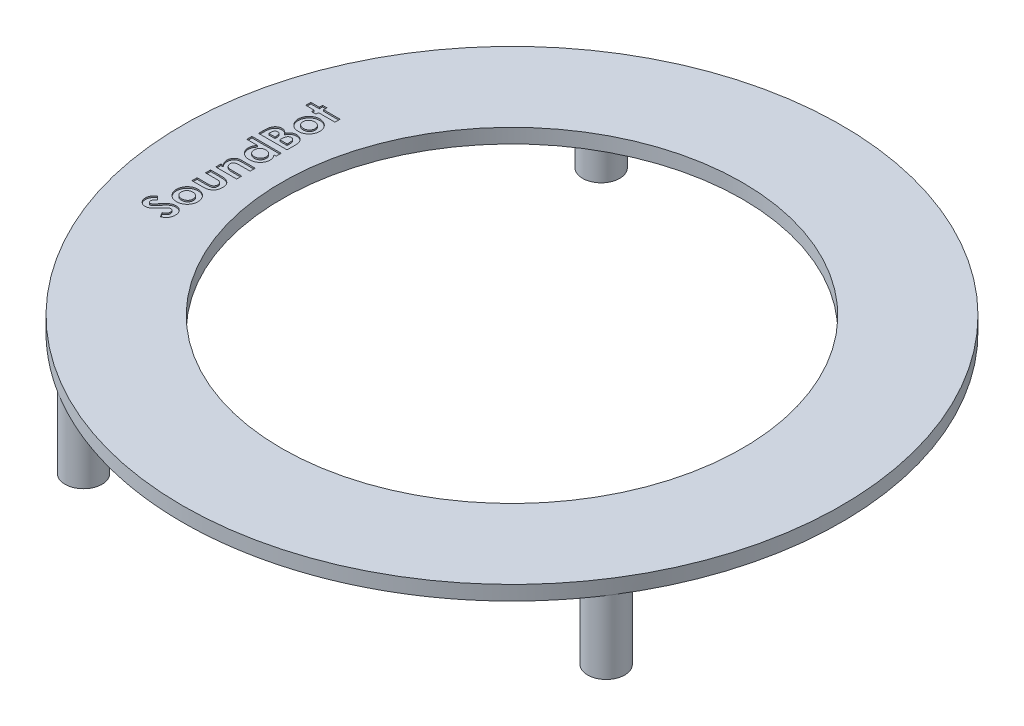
from build123d import *

# Parameters (mm, degrees)
SKETCH1_R           = 29.337
SKETCH1_R_2         = 20.5105
BOSS_EXTRUDE1_DEPTH = 1.2827
SKETCH2_R           = 1.651
SKETCH2_R_2         = 0.762
BOSS_EXTRUDE2_DEPTH = 6.5024
CUT_EXTRUDE3_DEPTH  = 0.127


with BuildPart() as part:
    # Sketch1 → Boss-Extrude1 (new body)
    with BuildSketch(Plane(origin=(0, 0, 0), x_dir=(1, 0, 0), z_dir=(0, 1, 0))):
        with Locations(Location((0, 0, 0), (0, 0, 270))):
            Circle(SKETCH1_R)
        with Locations(Location((0, 0, 0), (0, 0, 270))):
            Circle(SKETCH1_R_2, mode=Mode.SUBTRACT)
    extrude(amount=BOSS_EXTRUDE1_DEPTH)

    # Sketch2 → Boss-Extrude2 (add)
    # profile 1 of 4: a face of its own
    with BuildSketch(Plane.XZ):
        with Locations(Location((23.314362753, 14.931680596, 0), (0, 0, 32.636876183))):
            Circle(SKETCH2_R)
        with Locations(Location((23.314362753, 14.931680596, 0), (0, 0, 270))):
            Circle(SKETCH2_R_2, mode=Mode.SUBTRACT)
    # profile 2 of 4: a face of its own
    with BuildSketch(Plane.XZ):
        with Locations(Location((15.2019, -23.139075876, 0), (0, 0, 303.303446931))):
            Circle(SKETCH2_R)
        with Locations(Location((15.2019, -23.139075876, 0), (0, 0, 270))):
            Circle(SKETCH2_R_2, mode=Mode.SUBTRACT)
    # profile 3 of 4: a face of its own
    with BuildSketch(Plane.XZ):
        with Locations(Location((-15.2019, -23.139075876, 0), (0, 0, 236.695254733))):
            Circle(SKETCH2_R)
        with Locations(Location((-15.2019, -23.139075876, 0), (0, 0, 270))):
            Circle(SKETCH2_R_2, mode=Mode.SUBTRACT)
    # profile 4 of 4: a face of its own
    with BuildSketch(Plane.XZ):
        with Locations(Location((-14.659440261, 23.486494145, 0), (0, 0, 121.970304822))):
            Circle(SKETCH2_R)
        with Locations(Location((-14.659440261, 23.486494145, 0), (0, 0, 270))):
            Circle(SKETCH2_R_2, mode=Mode.SUBTRACT)
    extrude(amount=BOSS_EXTRUDE2_DEPTH)

    # Sketch3 → Cut-Extrude3 (cut)
    # profile 1 of 8: a face of its own
    with BuildSketch(Plane(origin=(0, 1.2827, 0), x_dir=(1, 0, 0), z_dir=(0, 1, 0))):
        with BuildLine():
            Line((-24.977884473, -6.560601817), (-24.665981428, -6.901507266))
            add(Edge.make_bspline(
                [(-24.665981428, -6.901507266), (-24.686580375, -6.916110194), (-24.726127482, -6.944145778), (-24.77908199, -6.989588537), (-24.824256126, -7.034826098), (-24.861461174, -7.08027756), (-24.890471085, -7.126345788), (-24.911010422, -7.172950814), (-24.924067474, -7.219828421), (-24.925693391, -7.251322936), (-24.926494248, -7.266835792)],
                knots=[0, 0, 0, 0, 1.299362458, 2.494594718, 3.587462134, 4.587049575, 5.512617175, 6.380583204, 7.202344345, 8, 8, 8, 8], degree=3))
            add(Edge.make_bspline(
                [(-24.926494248, -7.266835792), (-24.926001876, -7.28131288), (-24.925051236, -7.309264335), (-24.915126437, -7.348925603), (-24.899088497, -7.384567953), (-24.876934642, -7.415241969), (-24.85047651, -7.439918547), (-24.822310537, -7.45910606), (-24.791600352, -7.470255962), (-24.770538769, -7.47168783), (-24.760112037, -7.472396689)],
                knots=[0, 0, 0, 0, 1.184157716, 2.286297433, 3.324836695, 4.370048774, 5.362957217, 6.276446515, 7.146738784, 8, 8, 8, 8], degree=3))
            add(Edge.make_bspline(
                [(-24.760112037, -7.472396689), (-24.74953984, -7.471947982), (-24.728248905, -7.471044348), (-24.697044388, -7.462316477), (-24.666553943, -7.449161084), (-24.647992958, -7.436590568), (-24.638505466, -7.430165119)],
                knots=[0, 0, 0, 0, 0.967525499, 1.948461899, 2.951351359, 4, 4, 4, 4], degree=3))
            add(Edge.make_bspline(
                [(-24.638505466, -7.430165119), (-24.631151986, -7.424300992), (-24.614127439, -7.410724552), (-24.586756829, -7.385599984), (-24.554405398, -7.352793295), (-24.516400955, -7.313119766), (-24.47238267, -7.266717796), (-24.423085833, -7.212867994), (-24.368989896, -7.151176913), (-24.330852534, -7.107907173), (-24.310829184, -7.085189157)],
                knots=[0, 0, 0, 0, 0.473854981, 1.097054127, 1.870604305, 2.795416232, 3.865517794, 5.093525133, 6.47400653, 8, 8, 8, 8], degree=3))
            add(Edge.make_bspline(
                [(-24.310829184, -7.085189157), (-24.292343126, -7.063818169), (-24.257260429, -7.023260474), (-24.207384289, -6.965628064), (-24.162713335, -6.914649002), (-24.122913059, -6.870786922), (-24.089622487, -6.832731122), (-24.060793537, -6.802164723), (-24.03768735, -6.777779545), (-24.023715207, -6.763931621), (-24.017752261, -6.758021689)],
                knots=[0, 0, 0, 0, 1.543627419, 2.929484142, 4.163674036, 5.24627963, 6.164986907, 6.925413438, 7.541394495, 8, 8, 8, 8], degree=3))
            add(Edge.make_bspline(
                [(-24.017752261, -6.758021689), (-23.993483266, -6.735599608), (-23.946829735, -6.692496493), (-23.874549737, -6.63644332), (-23.804051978, -6.590512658), (-23.734184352, -6.554565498), (-23.663333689, -6.527666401), (-23.589971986, -6.508821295), (-23.513542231, -6.497363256), (-23.461488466, -6.496108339), (-23.435160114, -6.495473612)],
                knots=[0, 0, 0, 0, 1.206593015, 2.319495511, 3.336910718, 4.276265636, 5.184178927, 6.099356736, 7.038670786, 8, 8, 8, 8], degree=3))
            add(Edge.make_bspline(
                [(-23.435160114, -6.495473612), (-23.409507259, -6.495928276), (-23.359175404, -6.496820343), (-23.28552223, -6.507746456), (-23.215032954, -6.523326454), (-23.148474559, -6.547415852), (-23.084754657, -6.576775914), (-23.024865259, -6.613582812), (-22.968202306, -6.656808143), (-22.915770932, -6.706348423), (-22.868215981, -6.761155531), (-22.825797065, -6.819905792), (-22.791053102, -6.883398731), (-22.761297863, -6.950369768), (-22.740123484, -7.022041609), (-22.723464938, -7.097107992), (-22.713705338, -7.17634915), (-22.712666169, -7.230513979), (-22.712135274, -7.258185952)],
                knots=[0, 0, 0, 0, 1.043169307, 2.046737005, 3.02462096, 3.976528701, 4.921503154, 5.875710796, 6.831116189, 7.817539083, 8.805892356, 9.780872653, 10.7604363, 11.74661763, 12.757588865, 13.796088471, 14.874055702, 16, 16, 16, 16], degree=3))
            add(Edge.make_bspline(
                [(-22.712135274, -7.258185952), (-22.712520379, -7.279909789), (-22.713283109, -7.322935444), (-22.719518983, -7.386346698), (-22.729561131, -7.447585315), (-22.744030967, -7.506545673), (-22.762115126, -7.563689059), (-22.785201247, -7.618458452), (-22.81174098, -7.671247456), (-22.842304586, -7.721947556), (-22.877821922, -7.770239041), (-22.916902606, -7.817475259), (-22.961439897, -7.86210026), (-23.010569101, -7.905114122), (-23.064591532, -7.94596178), (-23.122687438, -7.986037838), (-23.185954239, -8.02354508), (-23.230335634, -8.046715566), (-23.253004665, -8.058550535)],
                knots=[0, 0, 0, 0, 1.016956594, 2.014157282, 2.980233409, 3.920138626, 4.854357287, 5.783465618, 6.699725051, 7.61900777, 8.551402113, 9.504102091, 10.486778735, 11.499758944, 12.559144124, 13.656050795, 14.802762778, 16, 16, 16, 16], degree=3))
            Line((-23.253004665, -8.058550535), (-23.493673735, -7.657605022))
            add(Edge.make_bspline(
                [(-23.493673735, -7.657605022), (-23.467941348, -7.642801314), (-23.418610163, -7.61442134), (-23.352327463, -7.566328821), (-23.295567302, -7.51706049), (-23.24933292, -7.465477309), (-23.213006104, -7.412206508), (-23.187044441, -7.356990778), (-23.170974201, -7.299791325), (-23.169011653, -7.260829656), (-23.16803271, -7.241395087)],
                knots=[0, 0, 0, 0, 1.283663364, 2.460892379, 3.537111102, 4.529833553, 5.449777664, 6.316464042, 7.160231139, 8, 8, 8, 8], degree=3))
            add(Edge.make_bspline(
                [(-23.16803271, -7.241395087), (-23.168832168, -7.221627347), (-23.170383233, -7.183275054), (-23.184709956, -7.128532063), (-23.207203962, -7.078341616), (-23.239299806, -7.034957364), (-23.276343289, -6.998222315), (-23.317555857, -6.97110974), (-23.362146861, -6.954077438), (-23.393122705, -6.952276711), (-23.40870178, -6.951371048)],
                knots=[0, 0, 0, 0, 1.13588714, 2.203786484, 3.234766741, 4.283437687, 5.291419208, 6.222934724, 7.106237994, 8, 8, 8, 8], degree=3))
            add(Edge.make_bspline(
                [(-23.40870178, -6.951371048), (-23.423195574, -6.95220739), (-23.452638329, -6.95390634), (-23.496414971, -6.966420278), (-23.540171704, -6.985983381), (-23.576062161, -7.009127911), (-23.606112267, -7.032680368), (-23.632149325, -7.055201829), (-23.660915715, -7.082627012), (-23.692447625, -7.114886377), (-23.727022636, -7.151553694), (-23.764637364, -7.192659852), (-23.804960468, -7.238675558), (-23.832428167, -7.27119955), (-23.846790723, -7.288205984)],
                knots=[0, 0, 0, 0, 0.916159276, 1.861089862, 2.860218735, 3.940849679, 4.552606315, 5.27541173, 6.11797699, 7.06649574, 8.129236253, 9.306560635, 10.591630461, 12, 12, 12, 12], degree=3))
            add(Edge.make_bspline(
                [(-23.846790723, -7.288205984), (-23.874144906, -7.32053592), (-23.926645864, -7.382586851), (-24.004188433, -7.47027226), (-24.076657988, -7.549286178), (-24.144955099, -7.618939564), (-24.207803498, -7.680141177), (-24.265761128, -7.732409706), (-24.319236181, -7.775465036), (-24.382998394, -7.820156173), (-24.460006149, -7.863133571), (-24.552596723, -7.900347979), (-24.645268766, -7.924265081), (-24.707569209, -7.926965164), (-24.73823303, -7.928294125)],
                knots=[0, 0, 0, 0, 1.345561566, 2.582539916, 3.71901348, 4.751744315, 5.681651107, 6.506005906, 7.230637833, 7.861516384, 8.978504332, 10.023243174, 11.027054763, 12, 12, 12, 12], degree=3))
            add(Edge.make_bspline(
                [(-24.73823303, -7.928294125), (-24.759979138, -7.927743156), (-24.802821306, -7.926657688), (-24.86581464, -7.916975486), (-24.92659726, -7.902504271), (-24.984950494, -7.881490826), (-25.040789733, -7.854207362), (-25.094432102, -7.821112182), (-25.145314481, -7.781430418), (-25.193937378, -7.737280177), (-25.237916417, -7.688049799), (-25.27671234, -7.635660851), (-25.309656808, -7.580343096), (-25.336102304, -7.521883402), (-25.357094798, -7.460759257), (-25.371800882, -7.396816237), (-25.380593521, -7.330174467), (-25.381784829, -7.284840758), (-25.382391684, -7.261747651)],
                knots=[0, 0, 0, 0, 1.010608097, 1.99100651, 2.956992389, 3.912457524, 4.868345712, 5.842283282, 6.837666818, 7.864758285, 8.892394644, 9.901925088, 10.892014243, 11.880216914, 12.880338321, 13.892361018, 14.926363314, 16, 16, 16, 16], degree=3))
            add(Edge.make_bspline(
                [(-25.382391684, -7.261747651), (-25.381296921, -7.231820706), (-25.379116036, -7.172203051), (-25.362061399, -7.08405705), (-25.335243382, -6.997958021), (-25.30288352, -6.92858325), (-25.271552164, -6.873370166), (-25.24265964, -6.831093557), (-25.209687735, -6.787823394), (-25.171707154, -6.744229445), (-25.129963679, -6.699253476), (-25.083495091, -6.653559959), (-25.032779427, -6.606662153), (-24.996503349, -6.576224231), (-24.977884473, -6.560601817)],
                knots=[0, 0, 0, 0, 1.282949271, 2.555771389, 3.837399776, 5.142782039, 5.830402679, 6.558840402, 7.337330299, 8.162747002, 9.037840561, 9.968992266, 10.957575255, 12, 12, 12, 12], degree=3))
        make_face()
    # profile 2 of 8: a face of its own
    with BuildSketch(Plane(origin=(0, 1.2827, 0), x_dir=(1, 0, 0), z_dir=(0, 1, 0))):
        with BuildLine():
            add(Edge.make_bspline(
                [(-24.665981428, -5.220385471), (-24.665602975, -5.19883028), (-24.664853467, -5.156141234), (-24.658455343, -5.092583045), (-24.648415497, -5.03001243), (-24.634005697, -4.968566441), (-24.616327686, -4.907895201), (-24.593614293, -4.848643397), (-24.567918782, -4.789720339), (-24.537215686, -4.732768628), (-24.503958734, -4.677323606), (-24.467210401, -4.62481119), (-24.427449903, -4.575335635), (-24.384805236, -4.529060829), (-24.339242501, -4.486255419), (-24.291250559, -4.446118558), (-24.239805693, -4.409774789), (-24.186019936, -4.37617493), (-24.130268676, -4.346248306), (-24.07292239, -4.320265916), (-24.014778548, -4.297714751), (-23.955127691, -4.28005786), (-23.894756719, -4.265439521), (-23.832925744, -4.256214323), (-23.770269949, -4.249655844), (-23.72808491, -4.24892043), (-23.706866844, -4.248550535)],
                knots=[0, 0, 0, 0, 1.022405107, 2.024825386, 3.027536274, 4.026883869, 5.01725043, 6.023055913, 7.035310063, 8.064783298, 9.090097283, 10.101295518, 11.102843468, 12.099336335, 13.084064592, 14.066917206, 15.06496821, 16.069711, 17.07409931, 18.064335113, 19.055093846, 20.030042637, 21.013718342, 21.999268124, 22.993679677, 24, 24, 24, 24], degree=3))
            add(Edge.make_bspline(
                [(-23.706866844, -4.248550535), (-23.685483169, -4.248941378), (-23.642967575, -4.249718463), (-23.579720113, -4.255971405), (-23.517607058, -4.266354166), (-23.456369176, -4.279630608), (-23.396665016, -4.298623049), (-23.337489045, -4.31992035), (-23.279950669, -4.34705014), (-23.223150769, -4.376650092), (-23.168463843, -4.409969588), (-23.116802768, -4.446949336), (-23.068072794, -4.486581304), (-23.02200993, -4.528730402), (-22.9796667, -4.574307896), (-22.940444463, -4.622909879), (-22.903813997, -4.674052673), (-22.870648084, -4.72812111), (-22.841505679, -4.784418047), (-22.815231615, -4.841995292), (-22.793356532, -4.901189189), (-22.775518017, -4.961877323), (-22.761706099, -5.024096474), (-22.752323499, -5.087709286), (-22.745798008, -5.152578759), (-22.745067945, -5.196285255), (-22.744699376, -5.218350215)],
                knots=[0, 0, 0, 0, 1.012065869, 2.012216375, 3.004733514, 3.992205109, 4.97496602, 5.968164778, 6.966799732, 7.983091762, 8.999225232, 9.995016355, 10.988052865, 11.970944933, 12.947950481, 13.92969433, 14.925485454, 15.92373309, 16.929186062, 17.924491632, 18.917690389, 19.913513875, 20.91665649, 21.931711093, 22.955836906, 24, 24, 24, 24], degree=3))
            add(Edge.make_bspline(
                [(-22.744699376, -5.218350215), (-22.745647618, -5.250613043), (-22.747516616, -5.31420357), (-22.760284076, -5.407868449), (-22.782357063, -5.497806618), (-22.812815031, -5.584436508), (-22.853043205, -5.66695938), (-22.900757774, -5.74649269), (-22.958608, -5.821430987), (-23.023370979, -5.892521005), (-23.094661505, -5.957158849), (-23.170275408, -6.014196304), (-23.249972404, -6.06213863), (-23.333432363, -6.101701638), (-23.420796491, -6.132203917), (-23.511765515, -6.154240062), (-23.606605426, -6.16704042), (-23.671042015, -6.168891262), (-23.70381396, -6.169832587)],
                knots=[0, 0, 0, 0, 1.030098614, 2.030340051, 3.011502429, 3.982690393, 4.9563966, 5.938096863, 6.938909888, 7.973851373, 9.005145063, 10.007012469, 10.993347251, 11.969610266, 12.95101174, 13.942698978, 14.953672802, 16, 16, 16, 16], degree=3))
            add(Edge.make_bspline(
                [(-23.70381396, -6.169832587), (-23.738807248, -6.16885848), (-23.807585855, -6.166943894), (-23.908348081, -6.151741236), (-24.004823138, -6.12746423), (-24.096741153, -6.092616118), (-24.184271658, -6.048100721), (-24.26723004, -5.993757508), (-24.345635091, -5.929317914), (-24.393057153, -5.879970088), (-24.417171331, -5.854876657)],
                knots=[0, 0, 0, 0, 1.043912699, 2.05178951, 3.033892, 4.007821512, 4.978932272, 5.95884105, 6.962068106, 8, 8, 8, 8], degree=3))
            add(Edge.make_bspline(
                [(-24.417171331, -5.854876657), (-24.437159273, -5.831850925), (-24.476591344, -5.786425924), (-24.526604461, -5.712625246), (-24.569800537, -5.63706168), (-24.605315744, -5.558829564), (-24.632093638, -5.477710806), (-24.651585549, -5.394121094), (-24.663558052, -5.308077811), (-24.665169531, -5.249764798), (-24.665981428, -5.220385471)],
                knots=[0, 0, 0, 0, 1.048115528, 2.067714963, 3.060638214, 4.039924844, 5.017819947, 5.994373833, 6.98952318, 8, 8, 8, 8], degree=3))
        make_face()
        with BuildLine():
            add(Edge.make_bspline(
                [(-24.242648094, -5.210209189), (-24.24208267, -5.227866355), (-24.240969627, -5.262624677), (-24.234473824, -5.313645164), (-24.222877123, -5.362354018), (-24.205497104, -5.40840458), (-24.18504963, -5.452963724), (-24.158773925, -5.494775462), (-24.12791478, -5.534154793), (-24.093090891, -5.571256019), (-24.054155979, -5.604399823), (-24.012488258, -5.633792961), (-23.968333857, -5.658917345), (-23.921008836, -5.678562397), (-23.871551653, -5.694611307), (-23.81917184, -5.705511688), (-23.764414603, -5.71308662), (-23.726907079, -5.713649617), (-23.707884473, -5.713935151)],
                knots=[0, 0, 0, 0, 1.030405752, 2.028364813, 2.995676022, 3.944329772, 4.896127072, 5.85177522, 6.817820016, 7.811895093, 8.815529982, 9.795715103, 10.783861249, 11.772750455, 12.780524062, 13.813161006, 14.890905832, 16, 16, 16, 16], degree=3))
            add(Edge.make_bspline(
                [(-23.707884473, -5.713935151), (-23.688190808, -5.713601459), (-23.649703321, -5.712949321), (-23.593507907, -5.706190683), (-23.540173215, -5.695057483), (-23.489807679, -5.679199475), (-23.442093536, -5.659455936), (-23.397485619, -5.634735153), (-23.355758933, -5.605704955), (-23.317076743, -5.572619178), (-23.28214992, -5.536146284), (-23.251260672, -5.496979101), (-23.22604109, -5.454783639), (-23.204123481, -5.410988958), (-23.188129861, -5.364370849), (-23.176123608, -5.315713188), (-23.169709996, -5.264482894), (-23.168599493, -5.229559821), (-23.16803271, -5.211735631)],
                knots=[0, 0, 0, 0, 1.141979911, 2.23178043, 3.277659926, 4.298338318, 5.290546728, 6.26815979, 7.25071132, 8.234641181, 9.215812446, 10.176243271, 11.121178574, 12.06282999, 13.01190517, 13.973595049, 14.965754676, 16, 16, 16, 16], degree=3))
            add(Edge.make_bspline(
                [(-23.16803271, -5.211735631), (-23.168534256, -5.193901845), (-23.169517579, -5.158937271), (-23.176881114, -5.10765644), (-23.188469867, -5.058715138), (-23.204824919, -5.011898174), (-23.226276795, -4.967584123), (-23.25255164, -4.925603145), (-23.283066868, -4.885586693), (-23.318798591, -4.848851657), (-23.35755843, -4.814855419), (-23.399582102, -4.785010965), (-23.444423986, -4.760264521), (-23.491832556, -4.739444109), (-23.542077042, -4.723930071), (-23.595061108, -4.712837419), (-23.650510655, -4.70528385), (-23.688523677, -4.704730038), (-23.707884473, -4.704447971)],
                knots=[0, 0, 0, 0, 1.03148129, 2.022302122, 2.990961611, 3.937500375, 4.885462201, 5.833017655, 6.798640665, 7.791063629, 8.792613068, 9.77817235, 10.766512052, 11.750898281, 12.768848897, 13.802335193, 14.880685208, 16, 16, 16, 16], degree=3))
            add(Edge.make_bspline(
                [(-23.707884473, -4.704447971), (-23.727239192, -4.704786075), (-23.765219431, -4.705449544), (-23.820734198, -4.712206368), (-23.873423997, -4.723238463), (-23.923063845, -4.7392711), (-23.970220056, -4.759059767), (-24.014651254, -4.783500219), (-24.056138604, -4.812842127), (-24.094476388, -4.846106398), (-24.12905503, -4.88289651), (-24.159890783, -4.921923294), (-24.185394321, -4.964079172), (-24.20641834, -5.008573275), (-24.222593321, -5.05552398), (-24.234599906, -5.104878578), (-24.240940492, -5.156788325), (-24.242072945, -5.19221613), (-24.242648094, -5.210209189)],
                knots=[0, 0, 0, 0, 1.123894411, 2.205445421, 3.243160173, 4.246488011, 5.231014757, 6.210004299, 7.185865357, 8.177612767, 9.153374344, 10.115157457, 11.061423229, 12.009021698, 12.96873347, 13.94135618, 14.954456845, 16, 16, 16, 16], degree=3))
        make_face(mode=Mode.SUBTRACT)
    # profile 3 of 8: a face of its own
    with BuildSketch(Plane(origin=(0, 1.2827, 0), x_dir=(1, 0, 0), z_dir=(0, 1, 0))):
        with BuildLine():
            Line((-24.633417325, -3.857781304), (-24.633417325, -3.401883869))
            Line((-24.633417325, -3.401883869), (-23.742483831, -3.401883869))
            add(Edge.make_bspline(
                [(-23.742483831, -3.401883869), (-23.72162034, -3.401843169), (-23.681578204, -3.401765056), (-23.624069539, -3.39960579), (-23.571481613, -3.396562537), (-23.523915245, -3.392820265), (-23.48133088, -3.387107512), (-23.443649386, -3.380514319), (-23.410653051, -3.373390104), (-23.374051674, -3.361026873), (-23.333968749, -3.342219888), (-23.290953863, -3.314285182), (-23.254506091, -3.279351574), (-23.223166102, -3.239467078), (-23.197716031, -3.193823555), (-23.181087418, -3.142435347), (-23.169758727, -3.086572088), (-23.168623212, -3.047641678), (-23.16803271, -3.027396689)],
                knots=[0, 0, 0, 0, 1.26765481, 2.432939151, 3.496235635, 4.468482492, 5.331342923, 6.105650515, 6.79313286, 7.379749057, 8.449369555, 9.475508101, 10.481577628, 11.502059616, 12.549100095, 13.637618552, 14.771490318, 16, 16, 16, 16], degree=3))
            add(Edge.make_bspline(
                [(-23.16803271, -3.027396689), (-23.168706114, -3.007168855), (-23.170005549, -2.9681362), (-23.180277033, -2.911912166), (-23.197559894, -2.860367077), (-23.222111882, -2.813916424), (-23.253094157, -2.772245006), (-23.291056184, -2.736618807), (-23.335520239, -2.7064002), (-23.368739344, -2.69190346), (-23.385805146, -2.684455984)],
                knots=[0, 0, 0, 0, 1.117055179, 2.15552637, 3.145290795, 4.109392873, 5.046474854, 6.001011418, 6.973050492, 8, 8, 8, 8], degree=3))
            add(Edge.make_bspline(
                [(-23.385805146, -2.684455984), (-23.393384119, -2.681721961), (-23.41011383, -2.675686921), (-23.438974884, -2.670315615), (-23.473011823, -2.664534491), (-23.512918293, -2.659961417), (-23.558447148, -2.65737381), (-23.609655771, -2.654601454), (-23.666493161, -2.653188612), (-23.706357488, -2.653005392), (-23.727219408, -2.65290951)],
                knots=[0, 0, 0, 0, 0.56094539, 1.238222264, 2.041156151, 2.969685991, 4.036367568, 5.220421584, 6.545382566, 8, 8, 8, 8], degree=3))
            Line((-23.727219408, -2.65290951), (-24.633417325, -2.65290951))
            Line((-24.633417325, -2.65290951), (-24.633417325, -2.197012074))
            Line((-24.633417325, -2.197012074), (-23.853405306, -2.197012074))
            add(Edge.make_bspline(
                [(-23.853405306, -2.197012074), (-23.81473076, -2.197091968), (-23.740579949, -2.197245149), (-23.634211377, -2.201570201), (-23.537338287, -2.207608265), (-23.450006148, -2.215190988), (-23.372063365, -2.226439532), (-23.303801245, -2.240014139), (-23.244465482, -2.255105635), (-23.209308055, -2.268938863), (-23.192964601, -2.275369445)],
                knots=[0, 0, 0, 0, 1.388064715, 2.661340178, 3.820320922, 4.871937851, 5.806920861, 6.64504548, 7.370129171, 8, 8, 8, 8], degree=3))
            add(Edge.make_bspline(
                [(-23.192964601, -2.275369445), (-23.175374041, -2.283612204), (-23.140651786, -2.299882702), (-23.09128443, -2.328115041), (-23.044512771, -2.358551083), (-23.001437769, -2.392638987), (-22.961621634, -2.429682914), (-22.92415925, -2.468635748), (-22.890576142, -2.511251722), (-22.86000812, -2.556425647), (-22.832873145, -2.604787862), (-22.808826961, -2.656007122), (-22.789257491, -2.710636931), (-22.772669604, -2.768203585), (-22.760299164, -2.828972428), (-22.750929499, -2.892821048), (-22.746087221, -2.959819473), (-22.745169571, -3.005511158), (-22.744699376, -3.028923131)],
                knots=[0, 0, 0, 0, 0.997311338, 1.968606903, 2.91805772, 3.860812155, 4.785445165, 5.709667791, 6.633356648, 7.568312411, 8.508286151, 9.478643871, 10.470653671, 11.485274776, 12.552984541, 13.653035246, 14.797438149, 16, 16, 16, 16], degree=3))
            add(Edge.make_bspline(
                [(-22.744699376, -3.028923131), (-22.745006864, -3.054213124), (-22.745608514, -3.103697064), (-22.752745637, -3.176017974), (-22.762387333, -3.244807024), (-22.777213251, -3.309820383), (-22.796640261, -3.371005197), (-22.819889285, -3.428635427), (-22.847576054, -3.482387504), (-22.879139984, -3.532540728), (-22.914989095, -3.578658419), (-22.953501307, -3.621834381), (-22.996285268, -3.660362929), (-23.041587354, -3.696534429), (-23.090986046, -3.728136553), (-23.143207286, -3.756973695), (-23.198831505, -3.782080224), (-23.237793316, -3.795502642), (-23.257583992, -3.802320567)],
                knots=[0, 0, 0, 0, 1.21116517, 2.369839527, 3.478781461, 4.537307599, 5.560113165, 6.551481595, 7.51089908, 8.453199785, 9.386099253, 10.306565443, 11.221022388, 12.141093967, 13.080939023, 14.026457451, 14.997537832, 16, 16, 16, 16], degree=3))
            add(Edge.make_bspline(
                [(-23.257583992, -3.802320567), (-23.272955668, -3.806970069), (-23.306069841, -3.81698618), (-23.361101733, -3.827800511), (-23.424529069, -3.836450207), (-23.49641424, -3.844864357), (-23.576877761, -3.850734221), (-23.665791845, -3.854570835), (-23.763330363, -3.857163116), (-23.831185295, -3.857569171), (-23.866634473, -3.857781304)],
                knots=[0, 0, 0, 0, 0.627914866, 1.352675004, 2.190563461, 3.132055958, 4.183353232, 5.345633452, 6.613289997, 8, 8, 8, 8], degree=3))
            Line((-23.866634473, -3.857781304), (-24.633417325, -3.857781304))
        make_face()
    # profile 4 of 8: a face of its own
    with BuildSketch(Plane(origin=(0, 1.2827, 0), x_dir=(1, 0, 0), z_dir=(0, 1, 0))):
        with BuildLine():
            Line((-24.633417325, -1.741114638), (-24.633417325, -1.285217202))
            Line((-24.633417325, -1.285217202), (-24.437015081, -1.285217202))
            add(Edge.make_bspline(
                [(-24.437015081, -1.285217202), (-24.457261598, -1.259217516), (-24.495956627, -1.209527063), (-24.545085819, -1.133776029), (-24.586167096, -1.062762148), (-24.61666966, -0.993911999), (-24.639007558, -0.926710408), (-24.65401572, -0.859503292), (-24.664387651, -0.79181941), (-24.665450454, -0.74625187), (-24.665981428, -0.723486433)],
                knots=[0, 0, 0, 0, 1.276368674, 2.439388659, 3.495912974, 4.452193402, 5.352134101, 6.235408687, 7.118414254, 8, 8, 8, 8], degree=3))
            add(Edge.make_bspline(
                [(-24.665981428, -0.723486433), (-24.665433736, -0.700385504), (-24.664358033, -0.655013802), (-24.654717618, -0.588461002), (-24.640200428, -0.524477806), (-24.619175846, -0.463105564), (-24.592097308, -0.404265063), (-24.558840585, -0.348321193), (-24.520075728, -0.294742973), (-24.489943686, -0.262205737), (-24.474667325, -0.24570999)],
                knots=[0, 0, 0, 0, 1.049021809, 2.060345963, 3.049166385, 4.026358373, 5.002121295, 5.98669893, 6.979295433, 8, 8, 8, 8], degree=3))
            add(Edge.make_bspline(
                [(-24.474667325, -0.24570999), (-24.46055979, -0.232449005), (-24.43224147, -0.20582998), (-24.383771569, -0.172358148), (-24.330833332, -0.143457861), (-24.272887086, -0.120269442), (-24.209889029, -0.102538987), (-24.142372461, -0.089284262), (-24.069822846, -0.081743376), (-24.019974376, -0.080820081), (-23.994346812, -0.080345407)],
                knots=[0, 0, 0, 0, 0.889614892, 1.785740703, 2.700456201, 3.659579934, 4.649837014, 5.707163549, 6.821231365, 8, 8, 8, 8], degree=3))
            Line((-23.994346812, -0.080345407), (-22.777263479, -0.080345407))
            Line((-22.777263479, -0.080345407), (-22.777263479, -0.536242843))
            Line((-22.777263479, -0.536242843), (-23.583225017, -0.536242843))
            add(Edge.make_bspline(
                [(-23.583225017, -0.536242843), (-23.609514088, -0.536339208), (-23.659892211, -0.536523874), (-23.731990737, -0.537943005), (-23.797105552, -0.540710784), (-23.855353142, -0.543241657), (-23.906533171, -0.548178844), (-23.951116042, -0.552724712), (-23.988587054, -0.559458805), (-24.028826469, -0.568475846), (-24.071705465, -0.583853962), (-24.116609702, -0.608553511), (-24.155429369, -0.638714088), (-24.187259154, -0.674902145), (-24.212683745, -0.71588195), (-24.229637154, -0.761985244), (-24.240898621, -0.812158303), (-24.242050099, -0.847231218), (-24.242648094, -0.865445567)],
                knots=[0, 0, 0, 0, 1.498383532, 2.871373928, 4.109666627, 5.213205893, 6.19342024, 7.03996831, 7.766265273, 8.361852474, 9.389264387, 10.349785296, 11.272242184, 12.176177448, 13.083054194, 14.00404103, 14.963442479, 16, 16, 16, 16], degree=3))
            add(Edge.make_bspline(
                [(-24.242648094, -0.865445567), (-24.24144467, -0.889124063), (-24.239090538, -0.935443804), (-24.221412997, -1.002467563), (-24.191193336, -1.063813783), (-24.150119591, -1.119700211), (-24.098519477, -1.168781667), (-24.036788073, -1.208905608), (-23.966912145, -1.242234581), (-23.915924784, -1.256475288), (-23.889531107, -1.26384701)],
                knots=[0, 0, 0, 0, 0.983981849, 1.924859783, 2.858520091, 3.812106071, 4.794873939, 5.802260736, 6.862337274, 8, 8, 8, 8], degree=3))
            add(Edge.make_bspline(
                [(-23.889531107, -1.26384701), (-23.8812436, -1.265681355), (-23.862760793, -1.269772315), (-23.831536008, -1.273134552), (-23.794323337, -1.277844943), (-23.750783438, -1.279530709), (-23.700965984, -1.282638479), (-23.644962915, -1.283740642), (-23.582551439, -1.284877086), (-23.538959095, -1.285100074), (-23.516061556, -1.285217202)],
                knots=[0, 0, 0, 0, 0.543362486, 1.211807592, 2.009706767, 2.945681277, 4.000992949, 5.207456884, 6.533174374, 8, 8, 8, 8], degree=3))
            Line((-23.516061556, -1.285217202), (-22.777263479, -1.285217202))
            Line((-22.777263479, -1.285217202), (-22.777263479, -1.741114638))
            Line((-22.777263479, -1.741114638), (-24.633417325, -1.741114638))
        make_face()
    # profile 5 of 8: a face of its own
    with BuildSketch(Plane(origin=(0, 1.2827, 0), x_dir=(1, 0, 0), z_dir=(0, 1, 0))):
        with BuildLine():
            Line((-25.382391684, 1.775808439), (-25.382391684, 2.231705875))
            Line((-25.382391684, 2.231705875), (-22.777263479, 2.231705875))
            Line((-22.777263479, 2.231705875), (-22.777263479, 1.775808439))
            Line((-22.777263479, 1.775808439), (-22.979771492, 1.775808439))
            add(Edge.make_bspline(
                [(-22.979771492, 1.775808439), (-22.960115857, 1.753180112), (-22.921903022, 1.709188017), (-22.871495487, 1.64061873), (-22.831336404, 1.570841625), (-22.798566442, 1.501220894), (-22.774536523, 1.429765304), (-22.757088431, 1.356226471), (-22.746810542, 1.279495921), (-22.745410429, 1.227337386), (-22.744699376, 1.200848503)],
                knots=[0, 0, 0, 0, 1.129123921, 2.195147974, 3.200207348, 4.157999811, 5.089597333, 6.035096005, 7.002117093, 8, 8, 8, 8], degree=3))
            add(Edge.make_bspline(
                [(-22.744699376, 1.200848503), (-22.745368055, 1.171113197), (-22.746689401, 1.112354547), (-22.760608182, 1.02613591), (-22.781893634, 0.942870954), (-22.812089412, 0.862685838), (-22.850984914, 0.785424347), (-22.898726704, 0.711520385), (-22.954451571, 0.640199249), (-23.018732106, 0.573483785), (-23.088582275, 0.511589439), (-23.163917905, 0.457942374), (-23.243231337, 0.412212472), (-23.326890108, 0.375179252), (-23.414596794, 0.34588417), (-23.50659924, 0.325030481), (-23.602901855, 0.312719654), (-23.66850051, 0.311196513), (-23.701778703, 0.310423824)],
                knots=[0, 0, 0, 0, 0.980565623, 1.937653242, 2.874408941, 3.813202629, 4.759425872, 5.723639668, 6.712366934, 7.741707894, 8.776921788, 9.78808311, 10.788528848, 11.79333378, 12.802261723, 13.835597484, 14.901998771, 16, 16, 16, 16], degree=3))
            add(Edge.make_bspline(
                [(-23.701778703, 0.310423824), (-23.736238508, 0.311234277), (-23.803835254, 0.312824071), (-23.903025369, 0.324471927), (-23.99731878, 0.344915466), (-24.086909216, 0.373003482), (-24.171824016, 0.408510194), (-24.251721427, 0.452668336), (-24.326888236, 0.504856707), (-24.396494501, 0.564462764), (-24.45938429, 0.629879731), (-24.514437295, 0.699302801), (-24.562095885, 0.77173659), (-24.599503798, 0.848605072), (-24.629267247, 0.928338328), (-24.650820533, 1.011488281), (-24.663806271, 1.098164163), (-24.665250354, 1.157215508), (-24.665981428, 1.187110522)],
                knots=[0, 0, 0, 0, 1.136200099, 2.228783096, 3.287341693, 4.313263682, 5.320819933, 6.317074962, 7.317731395, 8.33320375, 9.333922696, 10.3051871, 11.251461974, 12.186899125, 13.117710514, 14.053682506, 15.014667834, 16, 16, 16, 16], degree=3))
            add(Edge.make_bspline(
                [(-24.665981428, 1.187110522), (-24.665176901, 1.21479676), (-24.663585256, 1.269570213), (-24.651589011, 1.350214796), (-24.632067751, 1.428222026), (-24.605284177, 1.503788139), (-24.569681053, 1.576381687), (-24.526800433, 1.646248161), (-24.476221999, 1.713600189), (-24.437103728, 1.754810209), (-24.417171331, 1.775808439)],
                knots=[0, 0, 0, 0, 1.011981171, 2.002067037, 2.973628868, 3.94845042, 4.927444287, 5.923956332, 6.942168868, 8, 8, 8, 8], degree=3))
            Line((-24.417171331, 1.775808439), (-25.382391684, 1.775808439))
        make_face()
        with BuildLine():
            add(Edge.make_bspline(
                [(-24.242648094, 1.282767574), (-24.242090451, 1.26460155), (-24.240997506, 1.228997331), (-24.234429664, 1.176633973), (-24.222838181, 1.126599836), (-24.20577861, 1.079207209), (-24.18481058, 1.033992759), (-24.159403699, 0.99094693), (-24.128436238, 0.950687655), (-24.09361113, 0.912813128), (-24.0552846, 0.878050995), (-24.013130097, 0.848821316), (-23.969173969, 0.822868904), (-23.922266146, 0.801934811), (-23.872462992, 0.786437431), (-23.820317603, 0.774344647), (-23.765364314, 0.768039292), (-23.727911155, 0.766899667), (-23.708902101, 0.76632126)],
                knots=[0, 0, 0, 0, 1.048146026, 2.054297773, 3.039291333, 4.004895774, 4.954855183, 5.911393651, 6.882091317, 7.879305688, 8.877191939, 9.859995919, 10.833402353, 11.818978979, 12.815424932, 13.838562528, 14.902979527, 16, 16, 16, 16], degree=3))
            add(Edge.make_bspline(
                [(-23.708902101, 0.76632126), (-23.689720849, 0.766891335), (-23.651924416, 0.768014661), (-23.596504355, 0.774440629), (-23.543608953, 0.786123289), (-23.493707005, 0.803225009), (-23.446110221, 0.823853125), (-23.401317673, 0.849738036), (-23.359131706, 0.880172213), (-23.320109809, 0.915326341), (-23.28473787, 0.953712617), (-23.25356909, 0.994588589), (-23.226658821, 1.037468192), (-23.205606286, 1.082945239), (-23.188297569, 1.130139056), (-23.176876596, 1.17989138), (-23.169564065, 1.231669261), (-23.168546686, 1.266969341), (-23.16803271, 1.28480283)],
                knots=[0, 0, 0, 0, 1.099325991, 2.166209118, 3.191924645, 4.196940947, 5.184751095, 6.160002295, 7.155385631, 8.160260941, 9.164478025, 10.142244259, 11.102414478, 12.058888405, 13.008821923, 13.977708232, 14.978344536, 16, 16, 16, 16], degree=3))
            add(Edge.make_bspline(
                [(-23.16803271, 1.28480283), (-23.168592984, 1.303307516), (-23.169691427, 1.33958676), (-23.176206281, 1.392800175), (-23.187814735, 1.443521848), (-23.205064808, 1.491495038), (-23.225614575, 1.537699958), (-23.251906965, 1.581006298), (-23.282528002, 1.621971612), (-23.317757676, 1.659834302), (-23.355877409, 1.695100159), (-23.398233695, 1.725088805), (-23.442927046, 1.751412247), (-23.491090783, 1.77207989), (-23.541834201, 1.788502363), (-23.595485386, 1.800282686), (-23.652098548, 1.806691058), (-23.690739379, 1.80780496), (-23.710428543, 1.808372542)],
                knots=[0, 0, 0, 0, 1.050155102, 2.058874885, 3.037059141, 3.995876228, 4.947712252, 5.901735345, 6.864168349, 7.84500044, 8.832936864, 9.80518476, 10.78407896, 11.771077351, 12.772424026, 13.806938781, 14.882541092, 16, 16, 16, 16], degree=3))
            add(Edge.make_bspline(
                [(-23.710428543, 1.808372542), (-23.72977929, 1.807812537), (-23.767576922, 1.806718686), (-23.823004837, 1.800249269), (-23.875614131, 1.78841188), (-23.925577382, 1.772183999), (-23.972877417, 1.75140843), (-24.016606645, 1.724934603), (-24.05840239, 1.695112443), (-24.095931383, 1.659779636), (-24.130936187, 1.622080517), (-24.16014555, 1.580385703), (-24.185966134, 1.537056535), (-24.207044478, 1.491072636), (-24.222536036, 1.442268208), (-24.234519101, 1.391465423), (-24.240994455, 1.337884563), (-24.242087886, 1.301439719), (-24.242648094, 1.282767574)],
                knots=[0, 0, 0, 0, 1.106392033, 2.161105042, 3.184375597, 4.183944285, 5.160535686, 6.12997743, 7.101598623, 8.089721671, 9.071306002, 10.0372504, 10.99341283, 11.95232427, 12.921232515, 13.916134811, 14.932352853, 16, 16, 16, 16], degree=3))
        make_face(mode=Mode.SUBTRACT)
    # profile 6 of 8: a face of its own
    with BuildSketch(Plane(origin=(0, 1.2827, 0), x_dir=(1, 0, 0), z_dir=(0, 1, 0))):
        with BuildLine():
            Line((-22.777263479, 2.752731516), (-25.317263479, 2.752731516))
            Line((-25.317263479, 2.752731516), (-25.317263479, 3.159782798))
            add(Edge.make_bspline(
                [(-25.317263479, 3.159782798), (-25.317266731, 3.188278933), (-25.317273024, 3.243418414), (-25.314479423, 3.322970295), (-25.310865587, 3.396747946), (-25.306822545, 3.464516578), (-25.299855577, 3.526391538), (-25.292513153, 3.582278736), (-25.283658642, 3.632289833), (-25.275715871, 3.663208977), (-25.271979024, 3.677755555)],
                knots=[0, 0, 0, 0, 1.311965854, 2.538629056, 3.664479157, 4.713267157, 5.663616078, 6.530575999, 7.308677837, 8, 8, 8, 8], degree=3))
            add(Edge.make_bspline(
                [(-25.271979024, 3.677755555), (-25.266707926, 3.696856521), (-25.256364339, 3.734338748), (-25.235478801, 3.788028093), (-25.212248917, 3.838949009), (-25.185799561, 3.887090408), (-25.155637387, 3.931882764), (-25.122337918, 3.973940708), (-25.085889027, 4.013066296), (-25.046078, 4.048644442), (-25.003941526, 4.080732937), (-24.959504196, 4.108817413), (-24.913251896, 4.132775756), (-24.865086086, 4.152338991), (-24.815066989, 4.166933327), (-24.763353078, 4.177634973), (-24.70975777, 4.184564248), (-24.67329599, 4.185219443), (-24.654787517, 4.185552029)],
                knots=[0, 0, 0, 0, 1.099825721, 2.158211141, 3.195041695, 4.206926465, 5.204905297, 6.190538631, 7.183526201, 8.170733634, 9.152262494, 10.121785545, 11.086538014, 12.041584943, 13.004265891, 13.975982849, 14.972582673, 16, 16, 16, 16], degree=3))
            add(Edge.make_bspline(
                [(-24.654787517, 4.185552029), (-24.63100778, 4.184685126), (-24.584200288, 4.182978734), (-24.515467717, 4.172015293), (-24.450580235, 4.15168988), (-24.388395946, 4.124440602), (-24.328532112, 4.088458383), (-24.271732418, 4.041933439), (-24.216035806, 3.98658131), (-24.182665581, 3.944088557), (-24.165308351, 3.921986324)],
                knots=[0, 0, 0, 0, 0.986208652, 1.941230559, 2.875571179, 3.798165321, 4.751009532, 5.761494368, 6.83566093, 8, 8, 8, 8], degree=3))
            add(Edge.make_bspline(
                [(-24.165308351, 3.921986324), (-24.156167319, 3.939895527), (-24.138244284, 3.975010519), (-24.108767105, 4.02484789), (-24.077478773, 4.071050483), (-24.04478921, 4.113463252), (-24.010207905, 4.152347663), (-23.97384846, 4.187082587), (-23.93588893, 4.218563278), (-23.896067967, 4.246171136), (-23.854181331, 4.269969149), (-23.810843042, 4.290906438), (-23.765668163, 4.308931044), (-23.718558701, 4.32357798), (-23.669574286, 4.33487983), (-23.618828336, 4.342136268), (-23.566387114, 4.347719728), (-23.530663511, 4.348152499), (-23.512499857, 4.348372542)],
                knots=[0, 0, 0, 0, 1.164539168, 2.28333912, 3.351515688, 4.395009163, 5.383055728, 6.362812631, 7.305003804, 8.237049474, 9.165619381, 10.092784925, 11.02322402, 11.98030579, 12.947919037, 13.931657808, 14.948352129, 16, 16, 16, 16], degree=3))
            add(Edge.make_bspline(
                [(-23.512499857, 4.348372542), (-23.477807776, 4.346943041), (-23.409343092, 4.344121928), (-23.308836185, 4.323444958), (-23.21362783, 4.287789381), (-23.124219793, 4.239452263), (-23.042803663, 4.180190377), (-22.970901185, 4.112414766), (-22.91048825, 4.03592086), (-22.869661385, 3.965559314), (-22.842307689, 3.904671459), (-22.825318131, 3.854258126), (-22.809890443, 3.800017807), (-22.797818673, 3.741334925), (-22.788848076, 3.678611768), (-22.782305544, 3.611890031), (-22.778181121, 3.540935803), (-22.777575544, 3.49221382), (-22.777263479, 3.467106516)],
                knots=[0, 0, 0, 0, 1.284195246, 2.534354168, 3.78027825, 5.036354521, 6.286276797, 7.499025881, 8.683874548, 9.882754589, 10.501292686, 11.152751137, 11.850656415, 12.588451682, 13.369156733, 14.195917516, 15.070324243, 16, 16, 16, 16], degree=3))
            Line((-22.777263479, 3.467106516), (-22.777263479, 2.752731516))
        make_face()
        with BuildLine():
            Line((-24.861366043, 3.208628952), (-24.307776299, 3.208628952))
            Line((-24.307776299, 3.208628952), (-24.307776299, 3.329726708))
            add(Edge.make_bspline(
                [(-24.307776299, 3.329726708), (-24.307919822, 3.346184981), (-24.308196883, 3.377956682), (-24.311765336, 3.423847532), (-24.317853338, 3.466518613), (-24.326347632, 3.50580808), (-24.337134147, 3.54208193), (-24.350112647, 3.575108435), (-24.365947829, 3.604742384), (-24.38953503, 3.639170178), (-24.424244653, 3.675562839), (-24.474389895, 3.707598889), (-24.532056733, 3.726467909), (-24.572727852, 3.728569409), (-24.593729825, 3.729654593)],
                knots=[0, 0, 0, 0, 1.065314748, 2.056525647, 2.977365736, 3.853934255, 4.656397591, 5.425096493, 6.14721249, 6.826394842, 8.123232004, 9.372140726, 10.643011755, 12, 12, 12, 12], degree=3))
            add(Edge.make_bspline(
                [(-24.593729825, 3.729654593), (-24.613401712, 3.728786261), (-24.651436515, 3.727107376), (-24.704839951, 3.708108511), (-24.752169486, 3.678600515), (-24.784552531, 3.64375903), (-24.806693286, 3.610956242), (-24.8211987, 3.582847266), (-24.834468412, 3.552126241), (-24.843419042, 3.517687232), (-24.851982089, 3.480634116), (-24.857161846, 3.440250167), (-24.860994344, 3.396964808), (-24.861239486, 3.367049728), (-24.861366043, 3.351605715)],
                knots=[0, 0, 0, 0, 1.348076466, 2.606451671, 3.849585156, 5.153713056, 5.843081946, 6.568636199, 7.327130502, 8.139792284, 9.011860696, 9.942616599, 10.937851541, 12, 12, 12, 12], degree=3))
            Line((-24.861366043, 3.351605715), (-24.861366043, 3.208628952))
        make_face(mode=Mode.SUBTRACT)
        with BuildLine():
            Line((-23.884442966, 3.208628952), (-23.233160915, 3.208628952))
            Line((-23.233160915, 3.208628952), (-23.233160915, 3.33990299))
            add(Edge.make_bspline(
                [(-23.233160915, 3.33990299), (-23.233311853, 3.365855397), (-23.233602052, 3.415752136), (-23.237011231, 3.487239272), (-23.243334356, 3.552203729), (-23.25071691, 3.610660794), (-23.262389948, 3.662131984), (-23.274526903, 3.707557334), (-23.290138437, 3.746149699), (-23.308242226, 3.778567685), (-23.328720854, 3.805680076), (-23.350883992, 3.829157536), (-23.375649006, 3.848739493), (-23.402468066, 3.864487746), (-23.431093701, 3.877716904), (-23.462476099, 3.885820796), (-23.495639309, 3.891961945), (-23.518574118, 3.892301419), (-23.530308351, 3.892475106)],
                knots=[0, 0, 0, 0, 1.753677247, 3.371663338, 4.833688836, 6.164395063, 7.349095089, 8.3975697, 9.338276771, 10.154261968, 10.899224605, 11.628775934, 12.330426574, 13.024264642, 13.727131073, 14.452891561, 15.208446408, 16, 16, 16, 16], degree=3))
            add(Edge.make_bspline(
                [(-23.530308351, 3.892475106), (-23.543727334, 3.892093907), (-23.569863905, 3.891351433), (-23.608059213, 3.88526956), (-23.643740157, 3.874262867), (-23.67784458, 3.860193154), (-23.709396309, 3.841159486), (-23.738875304, 3.817976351), (-23.765568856, 3.790229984), (-23.791037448, 3.758961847), (-23.813521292, 3.72266951), (-23.832147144, 3.680742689), (-23.848532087, 3.633816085), (-23.861355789, 3.581102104), (-23.872315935, 3.523071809), (-23.878842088, 3.459248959), (-23.883702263, 3.390181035), (-23.884190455, 3.342287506), (-23.884442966, 3.31751517)],
                knots=[0, 0, 0, 0, 0.844975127, 1.645784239, 2.426462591, 3.192310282, 3.963577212, 4.739343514, 5.547598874, 6.383408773, 7.27567655, 8.226932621, 9.267447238, 10.402227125, 11.640487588, 12.984111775, 14.440069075, 16, 16, 16, 16], degree=3))
            Line((-23.884442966, 3.31751517), (-23.884442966, 3.208628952))
        make_face(mode=Mode.SUBTRACT)
    # profile 7 of 8: a face of its own
    with BuildSketch(Plane(origin=(0, 1.2827, 0), x_dir=(1, 0, 0), z_dir=(0, 1, 0))):
        with BuildLine():
            add(Edge.make_bspline(
                [(-24.665981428, 5.623460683), (-24.665602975, 5.645015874), (-24.664853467, 5.68770492), (-24.658455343, 5.751263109), (-24.648415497, 5.813833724), (-24.634005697, 5.875279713), (-24.616327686, 5.935950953), (-24.593614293, 5.995202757), (-24.567918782, 6.054125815), (-24.537215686, 6.111077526), (-24.503958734, 6.166522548), (-24.467210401, 6.219034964), (-24.427449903, 6.268510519), (-24.384805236, 6.314785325), (-24.339242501, 6.357590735), (-24.291250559, 6.397727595), (-24.239805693, 6.434071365), (-24.186019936, 6.467671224), (-24.130268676, 6.497597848), (-24.07292239, 6.523580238), (-24.014778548, 6.546131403), (-23.955127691, 6.563788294), (-23.894756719, 6.578406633), (-23.832925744, 6.58763183), (-23.770269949, 6.59419031), (-23.72808491, 6.594925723), (-23.706866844, 6.595295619)],
                knots=[0, 0, 0, 0, 1.022405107, 2.024825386, 3.027536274, 4.026883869, 5.01725043, 6.023055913, 7.035310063, 8.064783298, 9.090097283, 10.101295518, 11.102843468, 12.099336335, 13.084064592, 14.066917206, 15.06496821, 16.069711, 17.07409931, 18.064335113, 19.055093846, 20.030042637, 21.013718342, 21.999268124, 22.993679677, 24, 24, 24, 24], degree=3))
            add(Edge.make_bspline(
                [(-23.706866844, 6.595295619), (-23.685483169, 6.594904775), (-23.642967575, 6.594127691), (-23.579720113, 6.587874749), (-23.517607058, 6.577491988), (-23.456369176, 6.564215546), (-23.396665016, 6.545223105), (-23.337489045, 6.523925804), (-23.279950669, 6.496796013), (-23.223150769, 6.467196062), (-23.168463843, 6.433876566), (-23.116802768, 6.396896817), (-23.068072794, 6.35726485), (-23.02200993, 6.315115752), (-22.9796667, 6.269538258), (-22.940444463, 6.220936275), (-22.903813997, 6.169793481), (-22.870648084, 6.115725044), (-22.841505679, 6.059428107), (-22.815231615, 6.001850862), (-22.793356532, 5.942656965), (-22.775518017, 5.881968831), (-22.761706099, 5.81974968), (-22.752323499, 5.756136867), (-22.745798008, 5.691267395), (-22.745067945, 5.647560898), (-22.744699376, 5.625495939)],
                knots=[0, 0, 0, 0, 1.012065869, 2.012216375, 3.004733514, 3.992205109, 4.97496602, 5.968164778, 6.966799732, 7.983091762, 8.999225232, 9.995016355, 10.988052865, 11.970944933, 12.947950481, 13.92969433, 14.925485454, 15.92373309, 16.929186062, 17.924491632, 18.917690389, 19.913513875, 20.91665649, 21.931711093, 22.955836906, 24, 24, 24, 24], degree=3))
            add(Edge.make_bspline(
                [(-22.744699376, 5.625495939), (-22.745647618, 5.59323311), (-22.747516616, 5.529642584), (-22.760284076, 5.435977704), (-22.782357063, 5.346039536), (-22.812815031, 5.259409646), (-22.853043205, 5.176886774), (-22.900757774, 5.097353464), (-22.958608, 5.022415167), (-23.023370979, 4.951325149), (-23.094661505, 4.886687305), (-23.170275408, 4.82964985), (-23.249972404, 4.781707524), (-23.333432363, 4.742144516), (-23.420796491, 4.711642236), (-23.511765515, 4.689606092), (-23.606605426, 4.676805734), (-23.671042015, 4.674954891), (-23.70381396, 4.674013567)],
                knots=[0, 0, 0, 0, 1.030098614, 2.030340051, 3.011502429, 3.982690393, 4.9563966, 5.938096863, 6.938909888, 7.973851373, 9.005145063, 10.007012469, 10.993347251, 11.969610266, 12.95101174, 13.942698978, 14.953672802, 16, 16, 16, 16], degree=3))
            add(Edge.make_bspline(
                [(-23.70381396, 4.674013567), (-23.738807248, 4.674987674), (-23.807585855, 4.67690226), (-23.908348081, 4.692104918), (-24.004823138, 4.716381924), (-24.096741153, 4.751230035), (-24.184271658, 4.795745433), (-24.26723004, 4.850088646), (-24.345635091, 4.91452824), (-24.393057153, 4.963876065), (-24.417171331, 4.988969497)],
                knots=[0, 0, 0, 0, 1.043912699, 2.05178951, 3.033892, 4.007821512, 4.978932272, 5.95884105, 6.962068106, 8, 8, 8, 8], degree=3))
            add(Edge.make_bspline(
                [(-24.417171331, 4.988969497), (-24.437159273, 5.011995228), (-24.476591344, 5.05742023), (-24.526604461, 5.131220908), (-24.569800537, 5.206784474), (-24.605315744, 5.28501659), (-24.632093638, 5.366135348), (-24.651585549, 5.449725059), (-24.663558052, 5.535768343), (-24.665169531, 5.594081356), (-24.665981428, 5.623460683)],
                knots=[0, 0, 0, 0, 1.048115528, 2.067714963, 3.060638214, 4.039924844, 5.017819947, 5.994373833, 6.98952318, 8, 8, 8, 8], degree=3))
        make_face()
        with BuildLine():
            add(Edge.make_bspline(
                [(-24.242648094, 5.633636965), (-24.24208267, 5.615979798), (-24.240969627, 5.581221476), (-24.234473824, 5.53020099), (-24.222877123, 5.481492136), (-24.205497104, 5.435441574), (-24.18504963, 5.39088243), (-24.158773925, 5.349070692), (-24.12791478, 5.309691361), (-24.093090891, 5.272590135), (-24.054155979, 5.239446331), (-24.012488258, 5.210053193), (-23.968333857, 5.184928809), (-23.921008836, 5.165283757), (-23.871551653, 5.149234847), (-23.81917184, 5.138334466), (-23.764414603, 5.130759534), (-23.726907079, 5.130196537), (-23.707884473, 5.129911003)],
                knots=[0, 0, 0, 0, 1.030405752, 2.028364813, 2.995676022, 3.944329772, 4.896127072, 5.85177522, 6.817820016, 7.811895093, 8.815529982, 9.795715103, 10.783861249, 11.772750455, 12.780524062, 13.813161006, 14.890905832, 16, 16, 16, 16], degree=3))
            add(Edge.make_bspline(
                [(-23.707884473, 5.129911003), (-23.688190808, 5.130244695), (-23.649703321, 5.130896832), (-23.593507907, 5.137655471), (-23.540173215, 5.14878867), (-23.489807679, 5.164646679), (-23.442093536, 5.184390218), (-23.397485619, 5.209111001), (-23.355758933, 5.238141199), (-23.317076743, 5.271226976), (-23.28214992, 5.30769987), (-23.251260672, 5.346867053), (-23.22604109, 5.389062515), (-23.204123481, 5.432857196), (-23.188129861, 5.479475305), (-23.176123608, 5.528132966), (-23.169709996, 5.57936326), (-23.168599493, 5.614286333), (-23.16803271, 5.632110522)],
                knots=[0, 0, 0, 0, 1.141979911, 2.23178043, 3.277659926, 4.298338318, 5.290546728, 6.26815979, 7.25071132, 8.234641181, 9.215812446, 10.176243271, 11.121178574, 12.06282999, 13.01190517, 13.973595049, 14.965754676, 16, 16, 16, 16], degree=3))
            add(Edge.make_bspline(
                [(-23.16803271, 5.632110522), (-23.168534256, 5.649944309), (-23.169517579, 5.684908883), (-23.176881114, 5.736189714), (-23.188469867, 5.785131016), (-23.204824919, 5.831947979), (-23.226276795, 5.876262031), (-23.25255164, 5.918243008), (-23.283066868, 5.958259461), (-23.318798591, 5.994994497), (-23.35755843, 6.028990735), (-23.399582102, 6.058835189), (-23.444423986, 6.083581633), (-23.491832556, 6.104402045), (-23.542077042, 6.119916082), (-23.595061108, 6.131008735), (-23.650510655, 6.138562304), (-23.688523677, 6.139116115), (-23.707884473, 6.139398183)],
                knots=[0, 0, 0, 0, 1.03148129, 2.022302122, 2.990961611, 3.937500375, 4.885462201, 5.833017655, 6.798640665, 7.791063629, 8.792613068, 9.77817235, 10.766512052, 11.750898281, 12.768848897, 13.802335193, 14.880685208, 16, 16, 16, 16], degree=3))
            add(Edge.make_bspline(
                [(-23.707884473, 6.139398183), (-23.727239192, 6.139060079), (-23.765219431, 6.13839661), (-23.820734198, 6.131639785), (-23.873423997, 6.120607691), (-23.923063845, 6.104575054), (-23.970220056, 6.084786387), (-24.014651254, 6.060345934), (-24.056138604, 6.031004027), (-24.094476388, 5.997739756), (-24.12905503, 5.960949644), (-24.159890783, 5.92192286), (-24.185394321, 5.879766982), (-24.20641834, 5.835272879), (-24.222593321, 5.788322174), (-24.234599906, 5.738967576), (-24.240940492, 5.687057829), (-24.242072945, 5.651630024), (-24.242648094, 5.633636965)],
                knots=[0, 0, 0, 0, 1.123894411, 2.205445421, 3.243160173, 4.246488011, 5.231014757, 6.210004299, 7.185865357, 8.177612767, 9.153374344, 10.115157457, 11.061423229, 12.009021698, 12.96873347, 13.94135618, 14.954456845, 16, 16, 16, 16], degree=3))
        make_face(mode=Mode.SUBTRACT)
    # profile 8 of 8: a face of its own
    with BuildSketch(Plane(origin=(0, 1.2827, 0), x_dir=(1, 0, 0), z_dir=(0, 1, 0))):
        Polygon((-25.382391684, 7.018628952), (-25.382391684, 7.474526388), (-24.633417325, 7.474526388), (-24.633417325, 7.767603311), (-24.242648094, 7.767603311), (-24.242648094, 7.474526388), (-22.777263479, 7.474526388), (-22.777263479, 7.018628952), (-24.242648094, 7.018628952), (-24.242648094, 6.790680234), (-24.633417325, 6.790680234), (-24.633417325, 7.018628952), align=None)
    extrude(amount=-CUT_EXTRUDE3_DEPTH, mode=Mode.SUBTRACT)


solid = part.part
